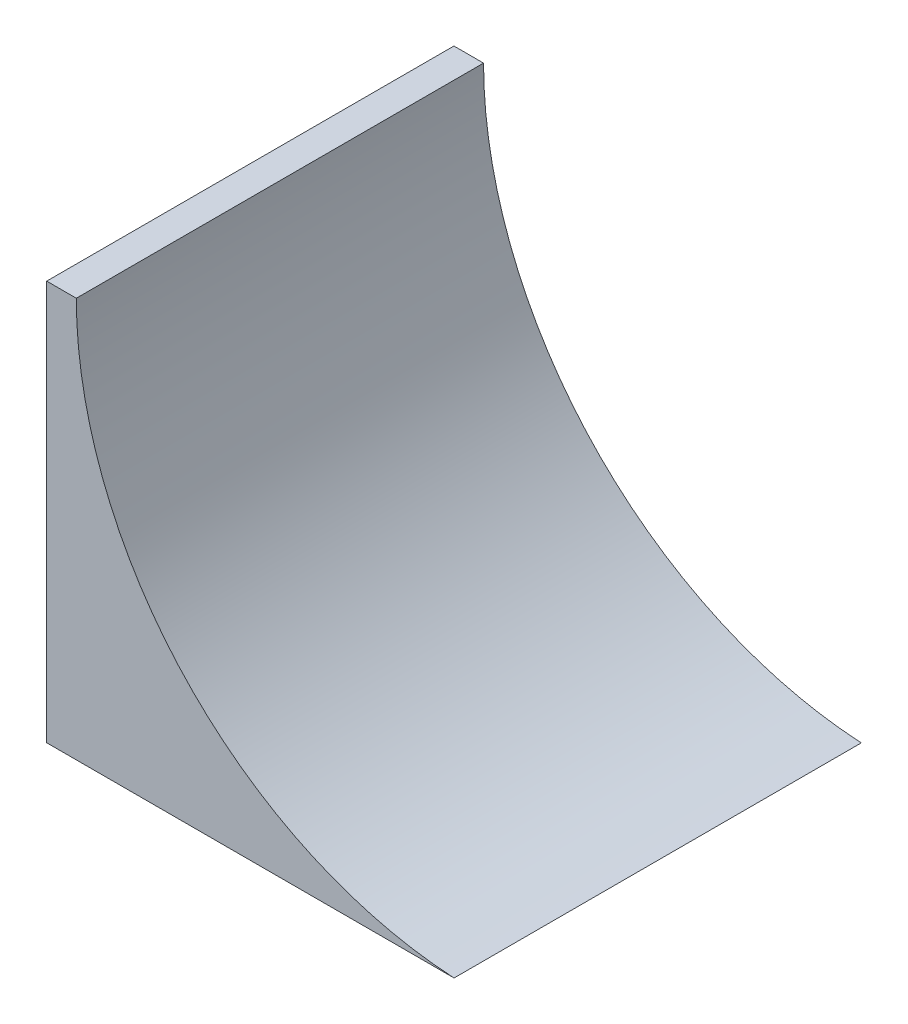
ISO-10303-21;
HEADER;
FILE_DESCRIPTION(('STEP AP214'),'2;1');
FILE_NAME('part.step','',(''),(''),'','','');
FILE_SCHEMA(('AUTOMOTIVE_DESIGN { 1 0 10303 214 1 1 1 1 }'));
ENDSEC;
DATA;
#1=APPLICATION_CONTEXT('core data for automotive mechanical design processes');
#2=APPLICATION_PROTOCOL_DEFINITION('international standard','automotive_design',2000,#1);
#3=PRODUCT_CONTEXT('',#1,'mechanical');
#4=PRODUCT('Part','Part','',(#3));
#5=PRODUCT_RELATED_PRODUCT_CATEGORY('part','',(#4));
#6=PRODUCT_DEFINITION_FORMATION('','',#4);
#7=PRODUCT_DEFINITION_CONTEXT('part definition',#1,'design');
#8=PRODUCT_DEFINITION('design','',#6,#7);
#9=PRODUCT_DEFINITION_SHAPE('','',#8);
#10=(LENGTH_UNIT() NAMED_UNIT(*) SI_UNIT(.MILLI.,.METRE.));
#11=(NAMED_UNIT(*) PLANE_ANGLE_UNIT() SI_UNIT($,.RADIAN.));
#12=(NAMED_UNIT(*) SI_UNIT($,.STERADIAN.) SOLID_ANGLE_UNIT());
#13=UNCERTAINTY_MEASURE_WITH_UNIT(LENGTH_MEASURE(1.E-05),#10,'distance_accuracy_value','');
#14=(GEOMETRIC_REPRESENTATION_CONTEXT(3) GLOBAL_UNCERTAINTY_ASSIGNED_CONTEXT((#13)) GLOBAL_UNIT_ASSIGNED_CONTEXT((#10,
#11,#12)) REPRESENTATION_CONTEXT('',''));
#15=CARTESIAN_POINT('',(0.,0.,0.));
#16=DIRECTION('',(0.,0.,1.));
#17=DIRECTION('',(1.,0.,0.));
#18=AXIS2_PLACEMENT_3D('',#15,#16,#17);
#19=CARTESIAN_POINT('',(0.,68.58,34.925));
#20=DIRECTION('',(0.,-1.,0.));
#21=DIRECTION('',(0.,0.,-1.));
#22=AXIS2_PLACEMENT_3D('',#19,#20,#21);
#23=PLANE('',#22);
#24=DIRECTION('',(-1.,0.,0.));
#25=VECTOR('',#24,1.);
#26=CARTESIAN_POINT('',(0.,68.58,-34.925));
#27=LINE('',#26,#25);
#28=CARTESIAN_POINT('',(5.08,68.58,-34.925));
#29=VERTEX_POINT('',#28);
#30=CARTESIAN_POINT('',(0.,68.58,-34.925));
#31=VERTEX_POINT('',#30);
#32=EDGE_CURVE('E95',#29,#31,#27,.T.);
#33=ORIENTED_EDGE('',*,*,#32,.T.);
#34=DIRECTION('',(0.,0.,-1.));
#35=VECTOR('',#34,1.);
#36=CARTESIAN_POINT('',(0.,68.58,34.925));
#37=LINE('',#36,#35);
#38=CARTESIAN_POINT('',(0.,68.58,34.925));
#39=VERTEX_POINT('',#38);
#40=EDGE_CURVE('E11',#39,#31,#37,.T.);
#41=ORIENTED_EDGE('',*,*,#40,.F.);
#42=DIRECTION('',(-1.,0.,0.));
#43=VECTOR('',#42,1.);
#44=CARTESIAN_POINT('',(0.,68.58,34.925));
#45=LINE('',#44,#43);
#46=CARTESIAN_POINT('',(5.08,68.58,34.925));
#47=VERTEX_POINT('',#46);
#48=EDGE_CURVE('E83',#47,#39,#45,.T.);
#49=ORIENTED_EDGE('',*,*,#48,.F.);
#50=DIRECTION('',(0.,0.,-1.));
#51=VECTOR('',#50,1.);
#52=CARTESIAN_POINT('',(5.08,68.58,34.925));
#53=LINE('',#52,#51);
#54=EDGE_CURVE('E91',#47,#29,#53,.T.);
#55=ORIENTED_EDGE('',*,*,#54,.T.);
#56=EDGE_LOOP('',(#33,#41,#49,#55));
#57=FACE_BOUND('',#56,.T.);
#58=ADVANCED_FACE('F32',(#57),#23,.F.);
#59=CARTESIAN_POINT('',(0.,0.,34.925));
#60=DIRECTION('',(1.,0.,0.));
#61=DIRECTION('',(0.,0.,-1.));
#62=AXIS2_PLACEMENT_3D('',#59,#60,#61);
#63=PLANE('',#62);
#64=CARTESIAN_POINT('',(0.,31.75,-17.4625));
#65=DIRECTION('',(-1.,0.,0.));
#66=DIRECTION('',(0.,0.,1.));
#67=AXIS2_PLACEMENT_3D('',#64,#65,#66);
#68=CIRCLE('',#67,4.064);
#69=CARTESIAN_POINT('',(0.,31.75,-13.3985));
#70=VERTEX_POINT('',#69);
#71=EDGE_CURVE('E115',#70,#70,#68,.T.);
#72=ORIENTED_EDGE('',*,*,#71,.F.);
#73=EDGE_LOOP('',(#72));
#74=FACE_BOUND('',#73,.T.);
#75=CARTESIAN_POINT('',(0.,31.75,17.4625));
#76=DIRECTION('',(-1.,0.,0.));
#77=DIRECTION('',(0.,0.,1.));
#78=AXIS2_PLACEMENT_3D('',#75,#76,#77);
#79=CIRCLE('',#78,4.064);
#80=CARTESIAN_POINT('',(0.,31.75,21.5265));
#81=VERTEX_POINT('',#80);
#82=EDGE_CURVE('E109',#81,#81,#79,.T.);
#83=ORIENTED_EDGE('',*,*,#82,.F.);
#84=EDGE_LOOP('',(#83));
#85=FACE_BOUND('',#84,.T.);
#86=DIRECTION('',(0.,-1.,0.));
#87=VECTOR('',#86,1.);
#88=CARTESIAN_POINT('',(0.,0.,-34.925));
#89=LINE('',#88,#87);
#90=CARTESIAN_POINT('',(0.,0.,-34.925));
#91=VERTEX_POINT('',#90);
#92=EDGE_CURVE('E87',#31,#91,#89,.T.);
#93=ORIENTED_EDGE('',*,*,#92,.T.);
#94=DIRECTION('',(0.,0.,-1.));
#95=VECTOR('',#94,1.);
#96=CARTESIAN_POINT('',(0.,0.,34.925));
#97=LINE('',#96,#95);
#98=CARTESIAN_POINT('',(0.,0.,34.925));
#99=VERTEX_POINT('',#98);
#100=EDGE_CURVE('E40',#99,#91,#97,.T.);
#101=ORIENTED_EDGE('',*,*,#100,.F.);
#102=DIRECTION('',(0.,-1.,0.));
#103=VECTOR('',#102,1.);
#104=CARTESIAN_POINT('',(0.,0.,34.925));
#105=LINE('',#104,#103);
#106=EDGE_CURVE('E78',#39,#99,#105,.T.);
#107=ORIENTED_EDGE('',*,*,#106,.F.);
#108=ORIENTED_EDGE('',*,*,#40,.T.);
#109=EDGE_LOOP('',(#93,#101,#107,#108));
#110=FACE_BOUND('',#109,.T.);
#111=ADVANCED_FACE('F86',(#74,#85,#110),#63,.F.);
#112=CARTESIAN_POINT('',(69.8752293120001,0.,34.925));
#113=DIRECTION('',(0.,1.,0.));
#114=DIRECTION('',(0.,0.,1.));
#115=AXIS2_PLACEMENT_3D('',#112,#113,#114);
#116=PLANE('',#115);
#117=DIRECTION('',(1.,0.,0.));
#118=VECTOR('',#117,1.);
#119=CARTESIAN_POINT('',(69.8752293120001,0.,-34.925));
#120=LINE('',#119,#118);
#121=CARTESIAN_POINT('',(69.8752293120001,0.,-34.925));
#122=VERTEX_POINT('',#121);
#123=EDGE_CURVE('E65',#91,#122,#120,.T.);
#124=ORIENTED_EDGE('',*,*,#123,.T.);
#125=DIRECTION('',(0.,0.,-1.));
#126=VECTOR('',#125,1.);
#127=CARTESIAN_POINT('',(69.8752293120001,0.,34.925));
#128=LINE('',#127,#126);
#129=CARTESIAN_POINT('',(69.8752293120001,0.,34.925));
#130=VERTEX_POINT('',#129);
#131=EDGE_CURVE('E88',#130,#122,#128,.T.);
#132=ORIENTED_EDGE('',*,*,#131,.F.);
#133=DIRECTION('',(1.,0.,0.));
#134=VECTOR('',#133,1.);
#135=CARTESIAN_POINT('',(69.8752293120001,0.,34.925));
#136=LINE('',#135,#134);
#137=EDGE_CURVE('E81',#99,#130,#136,.T.);
#138=ORIENTED_EDGE('',*,*,#137,.F.);
#139=ORIENTED_EDGE('',*,*,#100,.T.);
#140=EDGE_LOOP('',(#124,#132,#138,#139));
#141=FACE_BOUND('',#140,.T.);
#142=ADVANCED_FACE('F89',(#141),#116,.F.);
#143=CARTESIAN_POINT('',(73.7705366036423,68.58,34.925));
#144=DIRECTION('',(0.,0.,-1.));
#145=DIRECTION('',(-1.,0.,0.));
#146=AXIS2_PLACEMENT_3D('',#143,#144,#145);
#147=CYLINDRICAL_SURFACE('',#146,68.6905366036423);
#148=CARTESIAN_POINT('',(73.7705366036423,68.58,-34.925));
#149=DIRECTION('',(0.,0.,-1.));
#150=DIRECTION('',(1.,0.,0.));
#151=AXIS2_PLACEMENT_3D('',#148,#149,#150);
#152=CIRCLE('',#151,68.6905366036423);
#153=EDGE_CURVE('E71',#122,#29,#152,.T.);
#154=ORIENTED_EDGE('',*,*,#153,.T.);
#155=ORIENTED_EDGE('',*,*,#54,.F.);
#156=CARTESIAN_POINT('',(73.7705366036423,68.58,34.925));
#157=DIRECTION('',(0.,0.,-1.));
#158=DIRECTION('',(1.,0.,0.));
#159=AXIS2_PLACEMENT_3D('',#156,#157,#158);
#160=CIRCLE('',#159,68.6905366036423);
#161=EDGE_CURVE('E48',#130,#47,#160,.T.);
#162=ORIENTED_EDGE('',*,*,#161,.F.);
#163=ORIENTED_EDGE('',*,*,#131,.T.);
#164=EDGE_LOOP('',(#154,#155,#162,#163));
#165=FACE_BOUND('',#164,.T.);
#166=ADVANCED_FACE('F103',(#165),#147,.F.);
#167=CARTESIAN_POINT('',(73.7705366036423,68.58,34.925));
#168=DIRECTION('',(0.,0.,1.));
#169=DIRECTION('',(1.,0.,0.));
#170=AXIS2_PLACEMENT_3D('',#167,#168,#169);
#171=PLANE('',#170);
#172=ORIENTED_EDGE('',*,*,#48,.T.);
#173=ORIENTED_EDGE('',*,*,#106,.T.);
#174=ORIENTED_EDGE('',*,*,#137,.T.);
#175=ORIENTED_EDGE('',*,*,#161,.T.);
#176=EDGE_LOOP('',(#172,#173,#174,#175));
#177=FACE_BOUND('',#176,.T.);
#178=ADVANCED_FACE('F79',(#177),#171,.T.);
#179=CARTESIAN_POINT('',(73.7705366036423,68.58,-34.925));
#180=DIRECTION('',(0.,0.,1.));
#181=DIRECTION('',(1.,0.,0.));
#182=AXIS2_PLACEMENT_3D('',#179,#180,#181);
#183=PLANE('',#182);
#184=ORIENTED_EDGE('',*,*,#32,.F.);
#185=ORIENTED_EDGE('',*,*,#153,.F.);
#186=ORIENTED_EDGE('',*,*,#123,.F.);
#187=ORIENTED_EDGE('',*,*,#92,.F.);
#188=EDGE_LOOP('',(#184,#185,#186,#187));
#189=FACE_BOUND('',#188,.T.);
#190=ADVANCED_FACE('F106',(#189),#183,.F.);
#191=CARTESIAN_POINT('',(3.048,31.75,17.4625));
#192=DIRECTION('',(-1.,0.,0.));
#193=DIRECTION('',(0.,0.,1.));
#194=AXIS2_PLACEMENT_3D('',#191,#192,#193);
#195=CYLINDRICAL_SURFACE('',#194,4.064);
#196=CARTESIAN_POINT('',(3.048,31.75,17.4625));
#197=DIRECTION('',(-1.,0.,0.));
#198=DIRECTION('',(0.,0.,1.));
#199=AXIS2_PLACEMENT_3D('',#196,#197,#198);
#200=CIRCLE('',#199,4.064);
#201=CARTESIAN_POINT('',(3.048,31.75,21.5265));
#202=VERTEX_POINT('',#201);
#203=EDGE_CURVE('E112',#202,#202,#200,.T.);
#204=CARTESIAN_POINT('',(3.048,31.75,21.5265));
#205=CARTESIAN_POINT('',(3.01625,31.75,21.5265));
#206=CARTESIAN_POINT('',(2.9845,31.75,21.5265));
#207=CARTESIAN_POINT('',(2.921,31.75,21.5265));
#208=CARTESIAN_POINT('',(2.88925,31.75,21.5265));
#209=CARTESIAN_POINT('',(2.82575,31.75,21.5265));
#210=CARTESIAN_POINT('',(2.794,31.75,21.5265));
#211=CARTESIAN_POINT('',(2.7305,31.75,21.5265));
#212=CARTESIAN_POINT('',(2.69875,31.75,21.5265));
#213=CARTESIAN_POINT('',(2.63525,31.75,21.5265));
#214=CARTESIAN_POINT('',(2.6035,31.75,21.5265));
#215=CARTESIAN_POINT('',(2.54,31.75,21.5265));
#216=CARTESIAN_POINT('',(2.50825,31.75,21.5265));
#217=CARTESIAN_POINT('',(2.44475,31.75,21.5265));
#218=CARTESIAN_POINT('',(2.413,31.75,21.5265));
#219=CARTESIAN_POINT('',(2.3495,31.75,21.5265));
#220=CARTESIAN_POINT('',(2.31775,31.75,21.5265));
#221=CARTESIAN_POINT('',(2.25425,31.75,21.5265));
#222=CARTESIAN_POINT('',(2.2225,31.75,21.5265));
#223=CARTESIAN_POINT('',(2.159,31.75,21.5265));
#224=CARTESIAN_POINT('',(2.12725,31.75,21.5265));
#225=CARTESIAN_POINT('',(2.06375,31.75,21.5265));
#226=CARTESIAN_POINT('',(2.032,31.75,21.5265));
#227=CARTESIAN_POINT('',(1.9685,31.75,21.5265));
#228=CARTESIAN_POINT('',(1.93675,31.75,21.5265));
#229=CARTESIAN_POINT('',(1.87325,31.75,21.5265));
#230=CARTESIAN_POINT('',(1.8415,31.75,21.5265));
#231=CARTESIAN_POINT('',(1.778,31.75,21.5265));
#232=CARTESIAN_POINT('',(1.74625,31.75,21.5265));
#233=CARTESIAN_POINT('',(1.68275,31.75,21.5265));
#234=CARTESIAN_POINT('',(1.651,31.75,21.5265));
#235=CARTESIAN_POINT('',(1.5875,31.75,21.5265));
#236=CARTESIAN_POINT('',(1.55575,31.75,21.5265));
#237=CARTESIAN_POINT('',(1.49225,31.75,21.5265));
#238=CARTESIAN_POINT('',(1.4605,31.75,21.5265));
#239=CARTESIAN_POINT('',(1.397,31.75,21.5265));
#240=CARTESIAN_POINT('',(1.36525,31.75,21.5265));
#241=CARTESIAN_POINT('',(1.30175,31.75,21.5265));
#242=CARTESIAN_POINT('',(1.27,31.75,21.5265));
#243=CARTESIAN_POINT('',(1.2065,31.75,21.5265));
#244=CARTESIAN_POINT('',(1.17475,31.75,21.5265));
#245=CARTESIAN_POINT('',(1.11125,31.75,21.5265));
#246=CARTESIAN_POINT('',(1.0795,31.75,21.5265));
#247=CARTESIAN_POINT('',(1.016,31.75,21.5265));
#248=CARTESIAN_POINT('',(0.98425,31.75,21.5265));
#249=CARTESIAN_POINT('',(0.92075,31.75,21.5265));
#250=CARTESIAN_POINT('',(0.889,31.75,21.5265));
#251=CARTESIAN_POINT('',(0.8255,31.75,21.5265));
#252=CARTESIAN_POINT('',(0.79375,31.75,21.5265));
#253=CARTESIAN_POINT('',(0.73025,31.75,21.5265));
#254=CARTESIAN_POINT('',(0.6985,31.75,21.5265));
#255=CARTESIAN_POINT('',(0.635,31.75,21.5265));
#256=CARTESIAN_POINT('',(0.60325,31.75,21.5265));
#257=CARTESIAN_POINT('',(0.53975,31.75,21.5265));
#258=CARTESIAN_POINT('',(0.508,31.75,21.5265));
#259=CARTESIAN_POINT('',(0.4445,31.75,21.5265));
#260=CARTESIAN_POINT('',(0.41275,31.75,21.5265));
#261=CARTESIAN_POINT('',(0.34925,31.75,21.5265));
#262=CARTESIAN_POINT('',(0.3175,31.75,21.5265));
#263=CARTESIAN_POINT('',(0.254,31.75,21.5265));
#264=CARTESIAN_POINT('',(0.22225,31.75,21.5265));
#265=CARTESIAN_POINT('',(0.15875,31.75,21.5265));
#266=CARTESIAN_POINT('',(0.127,31.75,21.5265));
#267=CARTESIAN_POINT('',(0.0634999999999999,31.75,21.5265));
#268=CARTESIAN_POINT('',(0.03175,31.75,21.5265));
#269=CARTESIAN_POINT('',(0.,31.75,21.5265));
#270=B_SPLINE_CURVE_WITH_KNOTS('',3,(#204,#205,#206,#207,#208,#209,#210,#211,#212,#213,#214,
#215,#216,#217,#218,#219,#220,#221,#222,#223,#224,#225,#226,#227,#228,#229,#230,#231,#232,#233,
#234,#235,#236,#237,#238,#239,#240,#241,#242,#243,#244,#245,#246,#247,#248,#249,#250,#251,#252,
#253,#254,#255,#256,#257,#258,#259,#260,#261,#262,#263,#264,#265,#266,#267,#268,#269),
.UNSPECIFIED.,.F.,.F.,(4,2,2,2,2,2,2,2,2,2,2,2,2,2,2,2,2,2,2,2,2,2,2,2,2,2,2,2,2,2,2,2,4),(0.,
0.0952499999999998,0.1905,0.28575,0.381,0.47625,0.5715,0.66675,0.762,0.85725,0.9525,1.04775,
1.143,1.23825,1.3335,1.42875,1.524,1.61925,1.7145,1.80975,1.905,2.00025,2.0955,2.19075,2.286,
2.38125,2.4765,2.57175,2.667,2.76225,2.8575,2.95275,3.048),.UNSPECIFIED.);
#271=EDGE_CURVE('BSEAM134',#202,#81,#270,.T.);
#272=ORIENTED_EDGE('',*,*,#203,.F.);
#273=ORIENTED_EDGE('',*,*,#82,.T.);
#274=ORIENTED_EDGE('',*,*,#271,.T.);
#275=ORIENTED_EDGE('',*,*,#271,.F.);
#276=EDGE_LOOP('',(#272,#274,#273,#275));
#277=FACE_BOUND('',#276,.T.);
#278=ADVANCED_FACE('F134',(#277),#195,.F.);
#279=CARTESIAN_POINT('',(3.048,31.75,17.4625));
#280=DIRECTION('',(-1.,0.,0.));
#281=DIRECTION('',(0.,0.,1.));
#282=AXIS2_PLACEMENT_3D('',#279,#280,#281);
#283=PLANE('',#282);
#284=ORIENTED_EDGE('',*,*,#203,.T.);
#285=EDGE_LOOP('',(#284));
#286=FACE_BOUND('',#285,.T.);
#287=ADVANCED_FACE('F126',(#286),#283,.T.);
#288=CARTESIAN_POINT('',(3.048,31.75,-17.4625));
#289=DIRECTION('',(-1.,0.,0.));
#290=DIRECTION('',(0.,0.,1.));
#291=AXIS2_PLACEMENT_3D('',#288,#289,#290);
#292=CYLINDRICAL_SURFACE('',#291,4.064);
#293=CARTESIAN_POINT('',(3.048,31.75,-17.4625));
#294=DIRECTION('',(-1.,0.,0.));
#295=DIRECTION('',(0.,0.,1.));
#296=AXIS2_PLACEMENT_3D('',#293,#294,#295);
#297=CIRCLE('',#296,4.064);
#298=CARTESIAN_POINT('',(3.048,31.75,-13.3985));
#299=VERTEX_POINT('',#298);
#300=EDGE_CURVE('E98',#299,#299,#297,.T.);
#301=CARTESIAN_POINT('',(3.048,31.75,-13.3985));
#302=CARTESIAN_POINT('',(3.01625,31.75,-13.3985));
#303=CARTESIAN_POINT('',(2.9845,31.75,-13.3985));
#304=CARTESIAN_POINT('',(2.921,31.75,-13.3985));
#305=CARTESIAN_POINT('',(2.88925,31.75,-13.3985));
#306=CARTESIAN_POINT('',(2.82575,31.75,-13.3985));
#307=CARTESIAN_POINT('',(2.794,31.75,-13.3985));
#308=CARTESIAN_POINT('',(2.7305,31.75,-13.3985));
#309=CARTESIAN_POINT('',(2.69875,31.75,-13.3985));
#310=CARTESIAN_POINT('',(2.63525,31.75,-13.3985));
#311=CARTESIAN_POINT('',(2.6035,31.75,-13.3985));
#312=CARTESIAN_POINT('',(2.54,31.75,-13.3985));
#313=CARTESIAN_POINT('',(2.50825,31.75,-13.3985));
#314=CARTESIAN_POINT('',(2.44475,31.75,-13.3985));
#315=CARTESIAN_POINT('',(2.413,31.75,-13.3985));
#316=CARTESIAN_POINT('',(2.3495,31.75,-13.3985));
#317=CARTESIAN_POINT('',(2.31775,31.75,-13.3985));
#318=CARTESIAN_POINT('',(2.25425,31.75,-13.3985));
#319=CARTESIAN_POINT('',(2.2225,31.75,-13.3985));
#320=CARTESIAN_POINT('',(2.159,31.75,-13.3985));
#321=CARTESIAN_POINT('',(2.12725,31.75,-13.3985));
#322=CARTESIAN_POINT('',(2.06375,31.75,-13.3985));
#323=CARTESIAN_POINT('',(2.032,31.75,-13.3985));
#324=CARTESIAN_POINT('',(1.9685,31.75,-13.3985));
#325=CARTESIAN_POINT('',(1.93675,31.75,-13.3985));
#326=CARTESIAN_POINT('',(1.87325,31.75,-13.3985));
#327=CARTESIAN_POINT('',(1.8415,31.75,-13.3985));
#328=CARTESIAN_POINT('',(1.778,31.75,-13.3985));
#329=CARTESIAN_POINT('',(1.74625,31.75,-13.3985));
#330=CARTESIAN_POINT('',(1.68275,31.75,-13.3985));
#331=CARTESIAN_POINT('',(1.651,31.75,-13.3985));
#332=CARTESIAN_POINT('',(1.5875,31.75,-13.3985));
#333=CARTESIAN_POINT('',(1.55575,31.75,-13.3985));
#334=CARTESIAN_POINT('',(1.49225,31.75,-13.3985));
#335=CARTESIAN_POINT('',(1.4605,31.75,-13.3985));
#336=CARTESIAN_POINT('',(1.397,31.75,-13.3985));
#337=CARTESIAN_POINT('',(1.36525,31.75,-13.3985));
#338=CARTESIAN_POINT('',(1.30175,31.75,-13.3985));
#339=CARTESIAN_POINT('',(1.27,31.75,-13.3985));
#340=CARTESIAN_POINT('',(1.2065,31.75,-13.3985));
#341=CARTESIAN_POINT('',(1.17475,31.75,-13.3985));
#342=CARTESIAN_POINT('',(1.11125,31.75,-13.3985));
#343=CARTESIAN_POINT('',(1.0795,31.75,-13.3985));
#344=CARTESIAN_POINT('',(1.016,31.75,-13.3985));
#345=CARTESIAN_POINT('',(0.98425,31.75,-13.3985));
#346=CARTESIAN_POINT('',(0.92075,31.75,-13.3985));
#347=CARTESIAN_POINT('',(0.889,31.75,-13.3985));
#348=CARTESIAN_POINT('',(0.8255,31.75,-13.3985));
#349=CARTESIAN_POINT('',(0.79375,31.75,-13.3985));
#350=CARTESIAN_POINT('',(0.73025,31.75,-13.3985));
#351=CARTESIAN_POINT('',(0.6985,31.75,-13.3985));
#352=CARTESIAN_POINT('',(0.635,31.75,-13.3985));
#353=CARTESIAN_POINT('',(0.60325,31.75,-13.3985));
#354=CARTESIAN_POINT('',(0.53975,31.75,-13.3985));
#355=CARTESIAN_POINT('',(0.508,31.75,-13.3985));
#356=CARTESIAN_POINT('',(0.4445,31.75,-13.3985));
#357=CARTESIAN_POINT('',(0.41275,31.75,-13.3985));
#358=CARTESIAN_POINT('',(0.34925,31.75,-13.3985));
#359=CARTESIAN_POINT('',(0.3175,31.75,-13.3985));
#360=CARTESIAN_POINT('',(0.254,31.75,-13.3985));
#361=CARTESIAN_POINT('',(0.22225,31.75,-13.3985));
#362=CARTESIAN_POINT('',(0.15875,31.75,-13.3985));
#363=CARTESIAN_POINT('',(0.127,31.75,-13.3985));
#364=CARTESIAN_POINT('',(0.0634999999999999,31.75,-13.3985));
#365=CARTESIAN_POINT('',(0.03175,31.75,-13.3985));
#366=CARTESIAN_POINT('',(0.,31.75,-13.3985));
#367=B_SPLINE_CURVE_WITH_KNOTS('',3,(#301,#302,#303,#304,#305,#306,#307,#308,#309,#310,#311,
#312,#313,#314,#315,#316,#317,#318,#319,#320,#321,#322,#323,#324,#325,#326,#327,#328,#329,#330,
#331,#332,#333,#334,#335,#336,#337,#338,#339,#340,#341,#342,#343,#344,#345,#346,#347,#348,#349,
#350,#351,#352,#353,#354,#355,#356,#357,#358,#359,#360,#361,#362,#363,#364,#365,#366),
.UNSPECIFIED.,.F.,.F.,(4,2,2,2,2,2,2,2,2,2,2,2,2,2,2,2,2,2,2,2,2,2,2,2,2,2,2,2,2,2,2,2,4),(0.,
0.0952499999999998,0.1905,0.28575,0.381,0.47625,0.5715,0.66675,0.762,0.85725,0.9525,1.04775,
1.143,1.23825,1.3335,1.42875,1.524,1.61925,1.7145,1.80975,1.905,2.00025,2.0955,2.19075,2.286,
2.38125,2.4765,2.57175,2.667,2.76225,2.8575,2.95275,3.048),.UNSPECIFIED.);
#368=EDGE_CURVE('BSEAM123',#299,#70,#367,.T.);
#369=ORIENTED_EDGE('',*,*,#300,.F.);
#370=ORIENTED_EDGE('',*,*,#71,.T.);
#371=ORIENTED_EDGE('',*,*,#368,.T.);
#372=ORIENTED_EDGE('',*,*,#368,.F.);
#373=EDGE_LOOP('',(#369,#371,#370,#372));
#374=FACE_BOUND('',#373,.T.);
#375=ADVANCED_FACE('F123',(#374),#292,.F.);
#376=CARTESIAN_POINT('',(3.048,31.75,-17.4625));
#377=DIRECTION('',(-1.,0.,0.));
#378=DIRECTION('',(0.,0.,1.));
#379=AXIS2_PLACEMENT_3D('',#376,#377,#378);
#380=PLANE('',#379);
#381=ORIENTED_EDGE('',*,*,#300,.T.);
#382=EDGE_LOOP('',(#381));
#383=FACE_BOUND('',#382,.T.);
#384=ADVANCED_FACE('F121',(#383),#380,.T.);
#385=CLOSED_SHELL('',(#58,#111,#142,#166,#178,#190,#278,#287,#375,#384));
#386=MANIFOLD_SOLID_BREP('B2',#385);
#387=ADVANCED_BREP_SHAPE_REPRESENTATION('',(#18,#386),#14);
#388=SHAPE_DEFINITION_REPRESENTATION(#9,#387);
ENDSEC;
END-ISO-10303-21;
